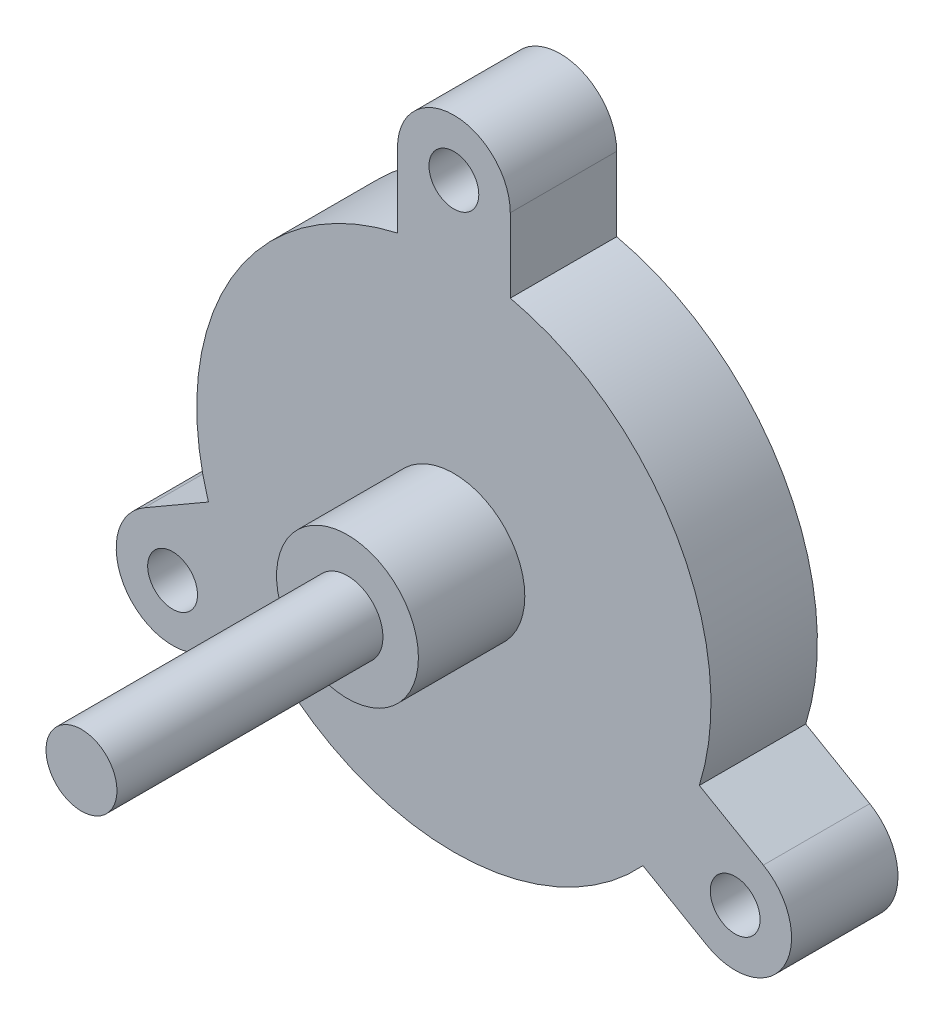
from build123d import *

# Parameters (mm, degrees)
SKETCH1_R                = 14.5
SKETCH1_R_2              = 12.5
BASE_EXTRUDE_DEPTH       = 6
BOSS_EXTRUDE1_START      = -6
SKETCH5_R                = 1.405
BOSS_EXTRUDE1_DEPTH      = 6
BOSS_EXTRUDE2_START      = -2
SKETCH7_R                = 12.5
SKETCH7_R_2              = 2.1
BOSS_EXTRUDE2_DEPTH      = 2
SKETCH8_R                = 4
SKETCH8_R_2              = 2
BOSS_EXTRUDE3_DEPTH      = 6
BOSS_EXTRUDE4_DEPTH      = 10
BOSS_EXTRUDE4_DEPTH_BACK = 20
SKETCH9_R                = 2
SKETCH10_R               = 2
BOSS_EXTRUDE5_DEPTH      = 5


with BuildPart() as part:
    # Sketch1 → Base-Extrude (new body)
    with BuildSketch(Plane.XY):
        Circle(SKETCH1_R)
        Circle(SKETCH1_R_2, mode=Mode.SUBTRACT)
    extrude(amount=BASE_EXTRUDE_DEPTH)

    # Sketch5 → Boss-Extrude1 (add)
    # profile 1 of 3: a face of its own
    with BuildSketch(Plane.XY.offset(6).offset(BOSS_EXTRUDE1_START)):
        with BuildLine():
            Line((3.18, 14.146999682), (3.18, 18.316999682))
            ThreePointArc((3.18, 18.316999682), (0, 21.496999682), (-3.18, 18.316999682))
            Line((-3.18, 18.316999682), (-3.18, 14.146999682))
            ThreePointArc((-3.18, 14.146999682), (0, 14.5), (3.18, 14.146999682))
        make_face()
        with Locations((0, 18.316999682)):
            Circle(SKETCH5_R, mode=Mode.SUBTRACT)
    # profile 2 of 3: a face of its own
    with BuildSketch(Plane.XY.offset(6).offset(BOSS_EXTRUDE1_START)):
        with BuildLine():
            Line((13.841661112, -4.319539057), (17.452987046, -6.404539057))
            ThreePointArc((17.452987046, -6.404539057), (18.61694783, -10.748499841), (14.272987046, -11.912460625))
            Line((14.272987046, -11.912460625), (10.661661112, -9.827460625))
            ThreePointArc((10.661661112, -9.827460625), (12.557368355, -7.25), (13.841661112, -4.319539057))
        make_face()
        with Locations(Location((15.862987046, -9.158499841, 0), (0, 0, 180))):
            Circle(SKETCH5_R, mode=Mode.SUBTRACT)
    # profile 3 of 3: a face of its own
    with BuildSketch(Plane.XY.offset(6).offset(BOSS_EXTRUDE1_START)):
        with BuildLine():
            Line((-10.661661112, -9.827460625), (-14.272987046, -11.912460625))
            ThreePointArc((-14.272987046, -11.912460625), (-18.61694783, -10.748499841), (-17.452987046, -6.404539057))
            Line((-17.452987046, -6.404539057), (-13.841661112, -4.319539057))
            ThreePointArc((-13.841661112, -4.319539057), (-12.557368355, -7.25), (-10.661661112, -9.827460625))
        make_face()
        with Locations((-15.862987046, -9.158499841)):
            Circle(SKETCH5_R, mode=Mode.SUBTRACT)
    extrude(amount=BOSS_EXTRUDE1_DEPTH)

    # Sketch7 → Boss-Extrude2 (add)
    with BuildSketch(Plane.XY.offset(6).offset(BOSS_EXTRUDE2_START)):
        Circle(SKETCH7_R)
        Circle(SKETCH7_R_2, mode=Mode.SUBTRACT)
    extrude(amount=BOSS_EXTRUDE2_DEPTH)

    # Sketch8 → Boss-Extrude3 (add)
    with BuildSketch(Plane.XY.offset(6)):
        Circle(SKETCH8_R)
        Circle(SKETCH8_R_2, mode=Mode.SUBTRACT)
    extrude(amount=BOSS_EXTRUDE3_DEPTH)

    # Sketch9 → Boss-Extrude4 (add, two sides: drawn at the far end of the back side and taken through both)
    with BuildSketch(Plane.XY.offset(12).offset(-BOSS_EXTRUDE4_DEPTH_BACK)):
        Circle(SKETCH9_R)
    extrude(amount=BOSS_EXTRUDE4_DEPTH + BOSS_EXTRUDE4_DEPTH_BACK)

    # Sketch10 → Boss-Extrude5 (add)
    with BuildSketch(Plane.XY.offset(22)):
        Circle(SKETCH10_R)
    extrude(amount=BOSS_EXTRUDE5_DEPTH)


solid = part.part
